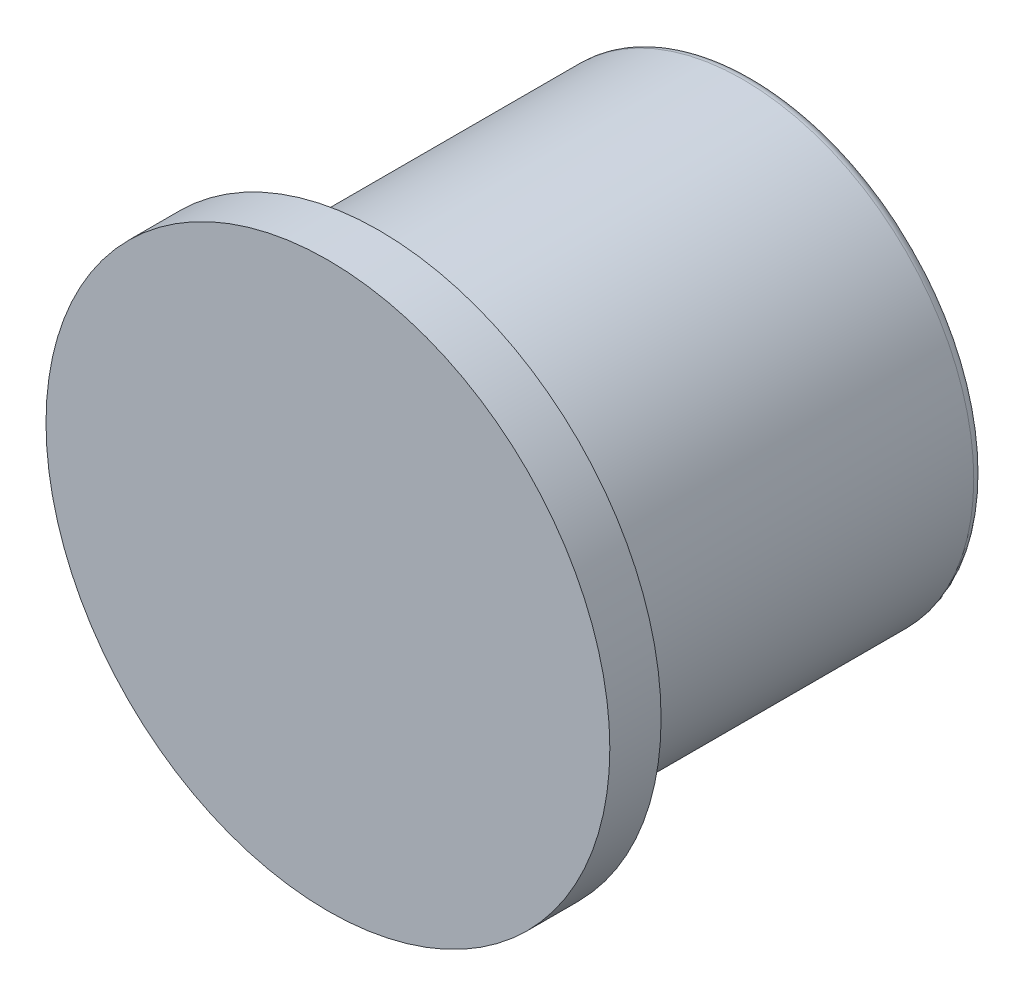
from build123d import *

# Parameters (mm, degrees)
M8_TAPPED_HOLE1_D           = 6.8
M8_TAPPED_HOLE1_DEPTH       = 19.75
M8_TAPPED_HOLE1_CSINK_D     = 9
M8_TAPPED_HOLE1_CSINK_ANGLE = 90
M8_TAPPED_HOLE1_TIP         = 2.042926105


with BuildPart() as part:
    # Sketch1 → Revolve1 (revolve)
    with BuildSketch(Plane(origin=(0, 0, 0), x_dir=(0, 0, -1), z_dir=(1, 0, 0)), mode=Mode.PRIVATE) as revolve1_sk:
        with BuildLine():
            Line((83, 0), (83, 43))
            ThreePointArc((83, 43), (82.414213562, 44.414213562), (81, 45))
            Line((81, 45), (10, 45))
            Line((10, 45), (10, 55))
            Line((10, 55), (0, 55))
            Line((0, 55), (0, 0))
            Line((0, 0), (83, 0))
        make_face()
    revolve(revolve1_sk.sketch.rotate(Axis((0, 0, 0), (0, 0, -1)), 90), axis=Axis((0, 0, 0), (0, 0, -1)))

    # M8 Tapped Hole1
    with Locations(Plane(origin=(0, 0, -83), x_dir=(-1, 0, 0), z_dir=(0, 0, -1))):
        with Locations((0, 0)):
            CounterSinkHole(M8_TAPPED_HOLE1_D / 2, M8_TAPPED_HOLE1_CSINK_D / 2, depth=M8_TAPPED_HOLE1_DEPTH, counter_sink_angle=M8_TAPPED_HOLE1_CSINK_ANGLE)
            with Locations((0, 0, -(M8_TAPPED_HOLE1_DEPTH + M8_TAPPED_HOLE1_TIP / 2))):  # 118° drill point
                Cone(0, M8_TAPPED_HOLE1_D / 2, M8_TAPPED_HOLE1_TIP, mode=Mode.SUBTRACT)


solid = part.part
